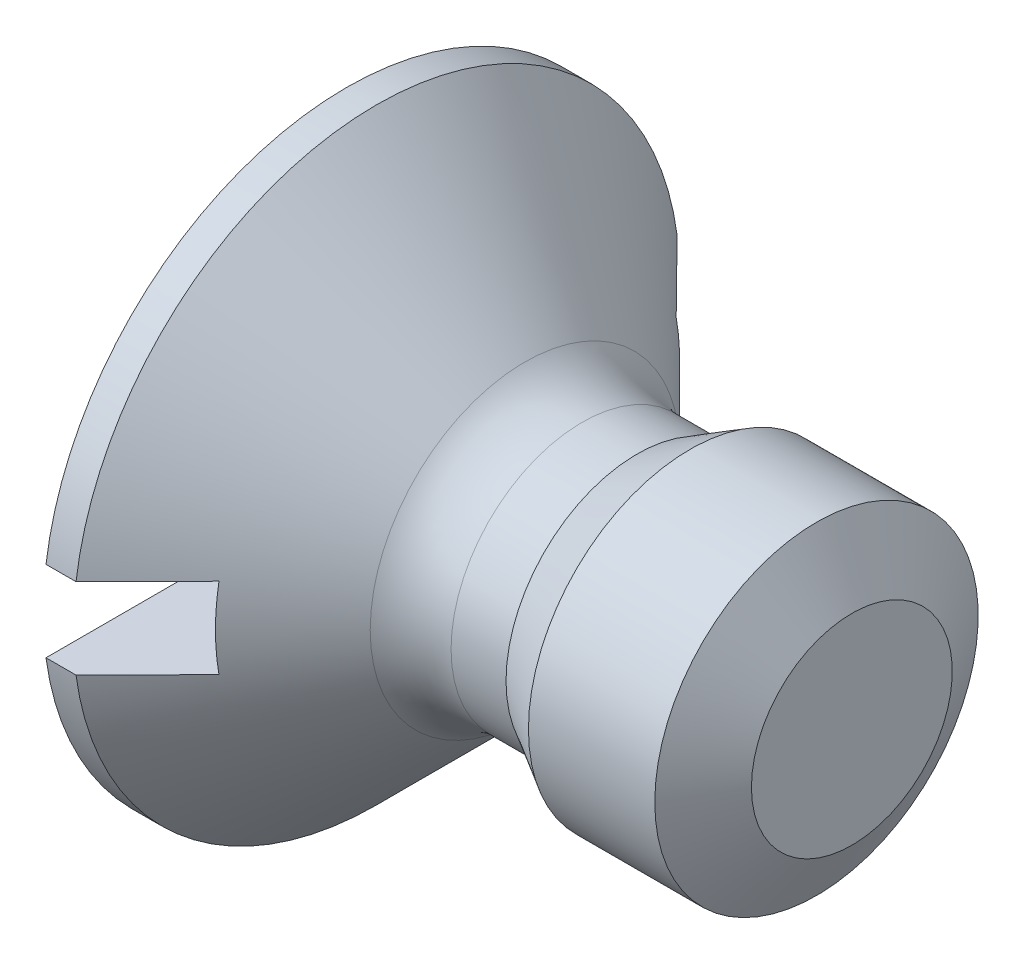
ISO-10303-21;
HEADER;
FILE_DESCRIPTION(('STEP AP214'),'2;1');
FILE_NAME('part.step','',(''),(''),'','','');
FILE_SCHEMA(('AUTOMOTIVE_DESIGN { 1 0 10303 214 1 1 1 1 }'));
ENDSEC;
DATA;
#1=APPLICATION_CONTEXT('core data for automotive mechanical design processes');
#2=APPLICATION_PROTOCOL_DEFINITION('international standard','automotive_design',2000,#1);
#3=PRODUCT_CONTEXT('',#1,'mechanical');
#4=PRODUCT('Part','Part','',(#3));
#5=PRODUCT_RELATED_PRODUCT_CATEGORY('part','',(#4));
#6=PRODUCT_DEFINITION_FORMATION('','',#4);
#7=PRODUCT_DEFINITION_CONTEXT('part definition',#1,'design');
#8=PRODUCT_DEFINITION('design','',#6,#7);
#9=PRODUCT_DEFINITION_SHAPE('','',#8);
#10=(LENGTH_UNIT() NAMED_UNIT(*) SI_UNIT(.MILLI.,.METRE.));
#11=(NAMED_UNIT(*) PLANE_ANGLE_UNIT() SI_UNIT($,.RADIAN.));
#12=(NAMED_UNIT(*) SI_UNIT($,.STERADIAN.) SOLID_ANGLE_UNIT());
#13=UNCERTAINTY_MEASURE_WITH_UNIT(LENGTH_MEASURE(1.E-05),#10,'distance_accuracy_value','');
#14=(GEOMETRIC_REPRESENTATION_CONTEXT(3) GLOBAL_UNCERTAINTY_ASSIGNED_CONTEXT((#13)) GLOBAL_UNIT_ASSIGNED_CONTEXT((#10,
#11,#12)) REPRESENTATION_CONTEXT('',''));
#15=CARTESIAN_POINT('',(0.,0.,0.));
#16=DIRECTION('',(0.,0.,1.));
#17=DIRECTION('',(1.,0.,0.));
#18=AXIS2_PLACEMENT_3D('',#15,#16,#17);
#19=CARTESIAN_POINT('',(0.,0.,0.));
#20=DIRECTION('',(1.,0.,0.));
#21=DIRECTION('',(0.,0.,-1.));
#22=AXIS2_PLACEMENT_3D('',#19,#20,#21);
#23=PLANE('',#22);
#24=CARTESIAN_POINT('',(0.,0.,0.));
#25=DIRECTION('',(-1.,0.,0.));
#26=DIRECTION('',(0.,0.,1.));
#27=AXIS2_PLACEMENT_3D('',#24,#25,#26);
#28=CIRCLE('',#27,1.5);
#29=CARTESIAN_POINT('',(0.,0.2,1.48660687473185));
#30=VERTEX_POINT('',#29);
#31=CARTESIAN_POINT('',(0.,0.2,-1.48660687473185));
#32=VERTEX_POINT('',#31);
#33=EDGE_CURVE('E108',#30,#32,#28,.T.);
#34=ORIENTED_EDGE('',*,*,#33,.T.);
#35=DIRECTION('',(0.,0.,-1.));
#36=VECTOR('',#35,1.);
#37=CARTESIAN_POINT('',(0.,0.2,-1.48660687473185));
#38=LINE('',#37,#36);
#39=EDGE_CURVE('E104',#30,#32,#38,.T.);
#40=ORIENTED_EDGE('',*,*,#39,.F.);
#41=EDGE_LOOP('',(#34,#40));
#42=FACE_BOUND('',#41,.T.);
#43=ADVANCED_FACE('F31',(#42),#23,.F.);
#44=CARTESIAN_POINT('',(0.,0.,0.));
#45=DIRECTION('',(-1.,0.,0.));
#46=DIRECTION('',(0.,0.,1.));
#47=AXIS2_PLACEMENT_3D('',#44,#45,#46);
#48=CYLINDRICAL_SURFACE('',#47,1.5);
#49=CARTESIAN_POINT('',(0.148450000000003,0.,0.));
#50=DIRECTION('',(-1.,0.,0.));
#51=DIRECTION('',(0.,0.,1.));
#52=AXIS2_PLACEMENT_3D('',#49,#50,#51);
#53=CIRCLE('',#52,1.5);
#54=CARTESIAN_POINT('',(0.148450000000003,0.2,1.48660687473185));
#55=VERTEX_POINT('',#54);
#56=CARTESIAN_POINT('',(0.148450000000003,0.2,-1.48660687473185));
#57=VERTEX_POINT('',#56);
#58=EDGE_CURVE('E109',#55,#57,#53,.T.);
#59=ORIENTED_EDGE('',*,*,#58,.T.);
#60=DIRECTION('',(-1.,0.,0.));
#61=VECTOR('',#60,1.);
#62=CARTESIAN_POINT('',(0.5,0.2,-1.48660687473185));
#63=LINE('',#62,#61);
#64=EDGE_CURVE('E60',#57,#32,#63,.T.);
#65=ORIENTED_EDGE('',*,*,#64,.T.);
#66=ORIENTED_EDGE('',*,*,#33,.F.);
#67=DIRECTION('',(-1.,0.,0.));
#68=VECTOR('',#67,1.);
#69=CARTESIAN_POINT('',(0.5,0.2,1.48660687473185));
#70=LINE('',#69,#68);
#71=EDGE_CURVE('E233',#55,#30,#70,.T.);
#72=ORIENTED_EDGE('',*,*,#71,.F.);
#73=EDGE_LOOP('',(#59,#65,#66,#72));
#74=FACE_BOUND('',#73,.T.);
#75=ADVANCED_FACE('F161',(#74),#48,.T.);
#76=CARTESIAN_POINT('',(0.,-0.2,-1.48660687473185));
#77=VERTEX_POINT('',#76);
#78=CARTESIAN_POINT('',(0.,-0.2,1.48660687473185));
#79=VERTEX_POINT('',#78);
#80=EDGE_CURVE('E103',#77,#79,#28,.T.);
#81=ORIENTED_EDGE('',*,*,#80,.T.);
#82=DIRECTION('',(0.,0.,1.));
#83=VECTOR('',#82,1.);
#84=CARTESIAN_POINT('',(0.,-0.2,-1.48660687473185));
#85=LINE('',#84,#83);
#86=EDGE_CURVE('E91',#77,#79,#85,.T.);
#87=ORIENTED_EDGE('',*,*,#86,.F.);
#88=EDGE_LOOP('',(#81,#87));
#89=FACE_BOUND('',#88,.T.);
#90=ADVANCED_FACE('F33',(#89),#23,.F.);
#91=CARTESIAN_POINT('',(0.148450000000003,-0.2,-1.48660687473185));
#92=VERTEX_POINT('',#91);
#93=CARTESIAN_POINT('',(0.148450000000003,-0.2,1.48660687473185));
#94=VERTEX_POINT('',#93);
#95=EDGE_CURVE('E114',#92,#94,#53,.T.);
#96=ORIENTED_EDGE('',*,*,#95,.T.);
#97=DIRECTION('',(-1.,0.,0.));
#98=VECTOR('',#97,1.);
#99=CARTESIAN_POINT('',(0.5,-0.2,1.48660687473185));
#100=LINE('',#99,#98);
#101=EDGE_CURVE('E98',#94,#79,#100,.T.);
#102=ORIENTED_EDGE('',*,*,#101,.T.);
#103=ORIENTED_EDGE('',*,*,#80,.F.);
#104=DIRECTION('',(-1.,0.,0.));
#105=VECTOR('',#104,1.);
#106=CARTESIAN_POINT('',(0.5,-0.2,-1.48660687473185));
#107=LINE('',#106,#105);
#108=EDGE_CURVE('E88',#92,#77,#107,.T.);
#109=ORIENTED_EDGE('',*,*,#108,.F.);
#110=EDGE_LOOP('',(#96,#102,#103,#109));
#111=FACE_BOUND('',#110,.T.);
#112=ADVANCED_FACE('F107',(#111),#48,.T.);
#113=CARTESIAN_POINT('',(0.882842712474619,0.,0.));
#114=DIRECTION('',(-1.,0.,0.));
#115=DIRECTION('',(0.,0.,1.));
#116=AXIS2_PLACEMENT_3D('',#113,#114,#115);
#117=CONICAL_SURFACE('',#116,0.765607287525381,0.78539816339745);
#118=CARTESIAN_POINT('',(0.5,0.,0.));
#119=DIRECTION('',(-1.,0.,0.));
#120=DIRECTION('',(0.,0.,1.));
#121=AXIS2_PLACEMENT_3D('',#118,#119,#120);
#122=CIRCLE('',#121,1.14845);
#123=CARTESIAN_POINT('',(0.5,0.2,-1.1309011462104));
#124=VERTEX_POINT('',#123);
#125=CARTESIAN_POINT('',(0.5,-0.2,-1.1309011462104));
#126=VERTEX_POINT('',#125);
#127=EDGE_CURVE('E119',#124,#126,#122,.T.);
#128=ORIENTED_EDGE('',*,*,#127,.F.);
#129=CARTESIAN_POINT('',(-1.64079797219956,0.2,3.28316192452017));
#130=CARTESIAN_POINT('',(-1.52906235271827,0.2,3.17121753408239));
#131=CARTESIAN_POINT('',(-1.41733577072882,0.2,3.0592641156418));
#132=CARTESIAN_POINT('',(-1.1939105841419,0.2,2.83532606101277));
#133=CARTESIAN_POINT('',(-1.08221197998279,0.2,2.72334142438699));
#134=CARTESIAN_POINT('',(-0.858818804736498,0.2,2.49929382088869));
#135=CARTESIAN_POINT('',(-0.747124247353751,0.2,2.38723084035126));
#136=CARTESIAN_POINT('',(-0.523798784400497,0.2,2.16304467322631));
#137=CARTESIAN_POINT('',(-0.412167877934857,0.2,2.05092148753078));
#138=CARTESIAN_POINT('',(-0.1856595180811,0.2,1.82321087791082));
#139=CARTESIAN_POINT('',(-0.0707851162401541,0.2,1.70762041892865));
#140=CARTESIAN_POINT('',(0.15878464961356,0.2,1.47625178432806));
#141=CARTESIAN_POINT('',(0.273480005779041,0.2,1.36047360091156));
#142=CARTESIAN_POINT('',(0.445217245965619,0.2,1.18652874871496));
#143=CARTESIAN_POINT('',(0.502405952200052,0.2,1.12850706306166));
#144=CARTESIAN_POINT('',(0.616628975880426,0.2,1.01230966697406));
#145=CARTESIAN_POINT('',(0.673663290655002,0.2,0.954133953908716));
#146=CARTESIAN_POINT('',(0.787464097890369,0.2,0.837530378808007));
#147=CARTESIAN_POINT('',(0.84423061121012,0.2,0.779102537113));
#148=CARTESIAN_POINT('',(0.957287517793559,0.2,0.661788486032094));
#149=CARTESIAN_POINT('',(1.01357792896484,0.2,0.602902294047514));
#150=CARTESIAN_POINT('',(1.08433312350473,0.2,0.527500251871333));
#151=CARTESIAN_POINT('',(1.09930695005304,0.2,0.511463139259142));
#152=CARTESIAN_POINT('',(1.12914382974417,0.2,0.479285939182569));
#153=CARTESIAN_POINT('',(1.14400688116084,0.2,0.463145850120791));
#154=CARTESIAN_POINT('',(1.18830724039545,0.2,0.414620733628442));
#155=CARTESIAN_POINT('',(1.21753737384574,0.2,0.382044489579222));
#156=CARTESIAN_POINT('',(1.26461313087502,0.2,0.327781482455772));
#157=CARTESIAN_POINT('',(1.28278251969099,0.2,0.306378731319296));
#158=CARTESIAN_POINT('',(1.31841836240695,0.2,0.26282885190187));
#159=CARTESIAN_POINT('',(1.33588112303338,0.2,0.240678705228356));
#160=CARTESIAN_POINT('',(1.36955751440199,0.2,0.195012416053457));
#161=CARTESIAN_POINT('',(1.3857554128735,0.2,0.171483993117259));
#162=CARTESIAN_POINT('',(1.40749300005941,0.2,0.134735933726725));
#163=CARTESIAN_POINT('',(1.41429686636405,0.2,0.12228076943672));
#164=CARTESIAN_POINT('',(1.42656593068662,0.2,0.0967396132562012));
#165=CARTESIAN_POINT('',(1.43203406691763,0.2,0.0836550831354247));
#166=CARTESIAN_POINT('',(1.4408859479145,0.2,0.0569118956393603));
#167=CARTESIAN_POINT('',(1.44429105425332,0.2,0.0432607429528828));
#168=CARTESIAN_POINT('',(1.44830199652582,0.2,0.0155962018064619));
#169=CARTESIAN_POINT('',(1.44892316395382,0.2,0.00158522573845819));
#170=CARTESIAN_POINT('',(1.44721841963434,0.2,-0.026228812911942));
#171=CARTESIAN_POINT('',(1.44489488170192,0.2,-0.0400320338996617));
#172=CARTESIAN_POINT('',(1.43791126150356,0.2,-0.067083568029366));
#173=CARTESIAN_POINT('',(1.43323625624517,0.2,-0.0803277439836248));
#174=CARTESIAN_POINT('',(1.42062778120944,0.2,-0.110185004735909));
#175=CARTESIAN_POINT('',(1.41213213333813,0.2,-0.126550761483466));
#176=CARTESIAN_POINT('',(1.39363560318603,0.2,-0.158424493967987));
#177=CARTESIAN_POINT('',(1.38363068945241,0.2,-0.173930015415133));
#178=CARTESIAN_POINT('',(1.36266689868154,0.2,-0.204438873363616));
#179=CARTESIAN_POINT('',(1.35170166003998,0.2,-0.219437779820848));
#180=CARTESIAN_POINT('',(1.32922788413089,0.2,-0.248984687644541));
#181=CARTESIAN_POINT('',(1.31772011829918,0.2,-0.263533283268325));
#182=CARTESIAN_POINT('',(1.27872953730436,0.2,-0.311589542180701));
#183=CARTESIAN_POINT('',(1.25045219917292,0.2,-0.344448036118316));
#184=CARTESIAN_POINT('',(1.1930407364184,0.2,-0.409411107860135));
#185=CARTESIAN_POINT('',(1.16390628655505,0.2,-0.441515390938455));
#186=CARTESIAN_POINT('',(1.1051245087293,0.2,-0.505329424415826));
#187=CARTESIAN_POINT('',(1.07547655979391,0.2,-0.537038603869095));
#188=CARTESIAN_POINT('',(1.01590439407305,0.2,-0.600184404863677));
#189=CARTESIAN_POINT('',(0.985980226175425,0.2,-0.631621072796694));
#190=CARTESIAN_POINT('',(0.89633646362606,0.2,-0.72526216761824));
#191=CARTESIAN_POINT('',(0.836354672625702,0.2,-0.787215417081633));
#192=CARTESIAN_POINT('',(0.716096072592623,0.2,-0.910754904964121));
#193=CARTESIAN_POINT('',(0.655819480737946,0.2,-0.972341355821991));
#194=CARTESIAN_POINT('',(0.503365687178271,0.2,-1.12762695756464));
#195=CARTESIAN_POINT('',(0.411062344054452,0.2,-1.22120227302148));
#196=CARTESIAN_POINT('',(0.226241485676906,0.2,-1.40814209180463));
#197=CARTESIAN_POINT('',(0.133723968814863,0.2,-1.50150659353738));
#198=CARTESIAN_POINT('',(-0.144062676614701,0.2,-1.78147675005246));
#199=CARTESIAN_POINT('',(-0.329511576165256,0.2,-1.96790402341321));
#200=CARTESIAN_POINT('',(-0.702570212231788,0.2,-2.34255801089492));
#201=CARTESIAN_POINT('',(-0.890181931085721,0.2,-2.53078274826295));
#202=CARTESIAN_POINT('',(-1.26545669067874,0.2,-2.90706401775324));
#203=CARTESIAN_POINT('',(-1.45311969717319,0.2,-3.09512058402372));
#204=CARTESIAN_POINT('',(-1.64079797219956,0.2,-3.28316192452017));
#205=B_SPLINE_CURVE_WITH_KNOTS('',3,(#129,#130,#131,#132,#133,#134,#135,#136,#137,#138,#139,
#140,#141,#142,#143,#144,#145,#146,#147,#148,#149,#150,#151,#152,#153,#154,#155,#156,#157,#158,
#159,#160,#161,#162,#163,#164,#165,#166,#167,#168,#169,#170,#171,#172,#173,#174,#175,#176,#177,
#178,#179,#180,#181,#182,#183,#184,#185,#186,#187,#188,#189,#190,#191,#192,#193,#194,#195,#196,
#197,#198,#199,#200,#201,#202,#203,#204),.UNSPECIFIED.,.F.,.F.,(4,2,2,2,2,2,2,2,2,2,2,2,2,2,2,2,
2,2,2,2,2,2,2,2,2,2,2,2,2,2,2,2,2,2,2,2,2,4),(0.,0.474497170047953,0.949001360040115,
1.42366341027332,1.89831861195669,2.38721073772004,2.87612372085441,3.12052815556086,
3.36493679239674,3.60932606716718,3.85370610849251,3.91952837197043,3.98535165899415,
4.11664175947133,4.20085258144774,4.28545804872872,4.37098789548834,4.41351615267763,
4.45595000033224,4.49793660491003,4.53969169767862,4.58141315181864,4.62340278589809,
4.67857158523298,4.73389044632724,4.78960840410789,4.8452493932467,4.97525677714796,
5.10531414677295,5.23554162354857,5.3657464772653,5.62443991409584,5.88296514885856,
6.27728151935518,6.67160086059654,7.46047152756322,8.25774212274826,9.0547641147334),.UNSPECIFIED.);
#206=EDGE_CURVE('E11',#124,#57,#205,.T.);
#207=ORIENTED_EDGE('',*,*,#206,.T.);
#208=ORIENTED_EDGE('',*,*,#58,.F.);
#209=CARTESIAN_POINT('',(0.5,0.2,1.1309011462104));
#210=VERTEX_POINT('',#209);
#211=EDGE_CURVE('E35',#55,#210,#205,.T.);
#212=ORIENTED_EDGE('',*,*,#211,.T.);
#213=CARTESIAN_POINT('',(0.5,-0.2,1.1309011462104));
#214=VERTEX_POINT('',#213);
#215=EDGE_CURVE('E112',#214,#210,#122,.T.);
#216=ORIENTED_EDGE('',*,*,#215,.F.);
#217=CARTESIAN_POINT('',(-1.64079797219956,-0.2,-3.28316192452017));
#218=CARTESIAN_POINT('',(-1.52906235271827,-0.2,-3.17121753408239));
#219=CARTESIAN_POINT('',(-1.41733577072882,-0.2,-3.0592641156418));
#220=CARTESIAN_POINT('',(-1.1939105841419,-0.2,-2.83532606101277));
#221=CARTESIAN_POINT('',(-1.08221197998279,-0.2,-2.72334142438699));
#222=CARTESIAN_POINT('',(-0.858818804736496,-0.2,-2.49929382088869));
#223=CARTESIAN_POINT('',(-0.747124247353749,-0.2,-2.38723084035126));
#224=CARTESIAN_POINT('',(-0.523798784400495,-0.2,-2.1630446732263));
#225=CARTESIAN_POINT('',(-0.412167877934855,-0.2,-2.05092148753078));
#226=CARTESIAN_POINT('',(-0.185659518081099,-0.2,-1.82321087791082));
#227=CARTESIAN_POINT('',(-0.0707851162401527,-0.2,-1.70762041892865));
#228=CARTESIAN_POINT('',(0.158784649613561,-0.2,-1.47625178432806));
#229=CARTESIAN_POINT('',(0.273480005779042,-0.2,-1.36047360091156));
#230=CARTESIAN_POINT('',(0.445217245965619,-0.2,-1.18652874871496));
#231=CARTESIAN_POINT('',(0.502405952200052,-0.2,-1.12850706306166));
#232=CARTESIAN_POINT('',(0.616628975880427,-0.2,-1.01230966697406));
#233=CARTESIAN_POINT('',(0.673663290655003,-0.2,-0.954133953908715));
#234=CARTESIAN_POINT('',(0.787464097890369,-0.2,-0.837530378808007));
#235=CARTESIAN_POINT('',(0.844230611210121,-0.2,-0.779102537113));
#236=CARTESIAN_POINT('',(0.957287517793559,-0.2,-0.661788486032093));
#237=CARTESIAN_POINT('',(1.01357792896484,-0.2,-0.602902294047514));
#238=CARTESIAN_POINT('',(1.08433312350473,-0.2,-0.527500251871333));
#239=CARTESIAN_POINT('',(1.09930695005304,-0.2,-0.511463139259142));
#240=CARTESIAN_POINT('',(1.12914382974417,-0.2,-0.479285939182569));
#241=CARTESIAN_POINT('',(1.14400688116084,-0.2,-0.463145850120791));
#242=CARTESIAN_POINT('',(1.18830724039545,-0.2,-0.414620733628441));
#243=CARTESIAN_POINT('',(1.21753737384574,-0.2,-0.382044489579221));
#244=CARTESIAN_POINT('',(1.26461313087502,-0.2,-0.327781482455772));
#245=CARTESIAN_POINT('',(1.28278251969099,-0.2,-0.306378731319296));
#246=CARTESIAN_POINT('',(1.31841836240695,-0.2,-0.26282885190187));
#247=CARTESIAN_POINT('',(1.33588112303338,-0.2,-0.240678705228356));
#248=CARTESIAN_POINT('',(1.36955751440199,-0.2,-0.195012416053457));
#249=CARTESIAN_POINT('',(1.3857554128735,-0.2,-0.171483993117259));
#250=CARTESIAN_POINT('',(1.40749300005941,-0.2,-0.134735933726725));
#251=CARTESIAN_POINT('',(1.41429686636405,-0.2,-0.12228076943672));
#252=CARTESIAN_POINT('',(1.42656593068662,-0.2,-0.0967396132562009));
#253=CARTESIAN_POINT('',(1.43203406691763,-0.2,-0.0836550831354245));
#254=CARTESIAN_POINT('',(1.4408859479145,-0.2,-0.0569118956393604));
#255=CARTESIAN_POINT('',(1.44429105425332,-0.2,-0.0432607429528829));
#256=CARTESIAN_POINT('',(1.44830199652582,-0.2,-0.015596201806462));
#257=CARTESIAN_POINT('',(1.44892316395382,-0.2,-0.00158522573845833));
#258=CARTESIAN_POINT('',(1.44721841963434,-0.2,0.0262288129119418));
#259=CARTESIAN_POINT('',(1.44489488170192,-0.2,0.0400320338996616));
#260=CARTESIAN_POINT('',(1.43791126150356,-0.2,0.0670835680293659));
#261=CARTESIAN_POINT('',(1.43323625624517,-0.2,0.0803277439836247));
#262=CARTESIAN_POINT('',(1.42062778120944,-0.2,0.110185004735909));
#263=CARTESIAN_POINT('',(1.41213213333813,-0.2,0.126550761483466));
#264=CARTESIAN_POINT('',(1.39363560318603,-0.2,0.158424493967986));
#265=CARTESIAN_POINT('',(1.38363068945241,-0.2,0.173930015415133));
#266=CARTESIAN_POINT('',(1.36266689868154,-0.2,0.204438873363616));
#267=CARTESIAN_POINT('',(1.35170166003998,-0.2,0.219437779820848));
#268=CARTESIAN_POINT('',(1.32922788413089,-0.2,0.248984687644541));
#269=CARTESIAN_POINT('',(1.31772011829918,-0.2,0.263533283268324));
#270=CARTESIAN_POINT('',(1.27872953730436,-0.2,0.3115895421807));
#271=CARTESIAN_POINT('',(1.25045219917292,-0.2,0.344448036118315));
#272=CARTESIAN_POINT('',(1.19304073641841,-0.2,0.409411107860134));
#273=CARTESIAN_POINT('',(1.16390628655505,-0.2,0.441515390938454));
#274=CARTESIAN_POINT('',(1.1051245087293,-0.2,0.505329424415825));
#275=CARTESIAN_POINT('',(1.07547655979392,-0.2,0.537038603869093));
#276=CARTESIAN_POINT('',(1.01590439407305,-0.2,0.600184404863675));
#277=CARTESIAN_POINT('',(0.985980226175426,-0.2,0.631621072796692));
#278=CARTESIAN_POINT('',(0.896336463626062,-0.2,0.725262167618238));
#279=CARTESIAN_POINT('',(0.836354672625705,-0.2,0.787215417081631));
#280=CARTESIAN_POINT('',(0.716096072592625,-0.2,0.910754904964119));
#281=CARTESIAN_POINT('',(0.655819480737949,-0.2,0.972341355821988));
#282=CARTESIAN_POINT('',(0.503365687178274,-0.2,1.12762695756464));
#283=CARTESIAN_POINT('',(0.411062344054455,-0.2,1.22120227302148));
#284=CARTESIAN_POINT('',(0.226241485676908,-0.2,1.40814209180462));
#285=CARTESIAN_POINT('',(0.133723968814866,-0.2,1.50150659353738));
#286=CARTESIAN_POINT('',(-0.144062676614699,-0.2,1.78147675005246));
#287=CARTESIAN_POINT('',(-0.329511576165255,-0.2,1.9679040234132));
#288=CARTESIAN_POINT('',(-0.702570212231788,-0.2,2.34255801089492));
#289=CARTESIAN_POINT('',(-0.890181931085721,-0.2,2.53078274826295));
#290=CARTESIAN_POINT('',(-1.26545669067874,-0.2,2.90706401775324));
#291=CARTESIAN_POINT('',(-1.45311969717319,-0.2,3.09512058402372));
#292=CARTESIAN_POINT('',(-1.64079797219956,-0.2,3.28316192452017));
#293=B_SPLINE_CURVE_WITH_KNOTS('',3,(#217,#218,#219,#220,#221,#222,#223,#224,#225,#226,#227,
#228,#229,#230,#231,#232,#233,#234,#235,#236,#237,#238,#239,#240,#241,#242,#243,#244,#245,#246,
#247,#248,#249,#250,#251,#252,#253,#254,#255,#256,#257,#258,#259,#260,#261,#262,#263,#264,#265,
#266,#267,#268,#269,#270,#271,#272,#273,#274,#275,#276,#277,#278,#279,#280,#281,#282,#283,#284,
#285,#286,#287,#288,#289,#290,#291,#292),.UNSPECIFIED.,.F.,.F.,(4,2,2,2,2,2,2,2,2,2,2,2,2,2,2,2,
2,2,2,2,2,2,2,2,2,2,2,2,2,2,2,2,2,2,2,2,2,4),(0.,0.474497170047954,0.949001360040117,
1.42366341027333,1.89831861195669,2.38721073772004,2.87612372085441,3.12052815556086,
3.36493679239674,3.60932606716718,3.85370610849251,3.91952837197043,3.98535165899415,
4.11664175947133,4.20085258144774,4.28545804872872,4.37098789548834,4.41351615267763,
4.45595000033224,4.49793660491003,4.53969169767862,4.58141315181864,4.62340278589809,
4.67857158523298,4.73389044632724,4.78960840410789,4.8452493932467,4.97525677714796,
5.10531414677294,5.23554162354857,5.36574647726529,5.62443991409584,5.88296514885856,
6.27728151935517,6.67160086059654,7.46047152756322,8.25774212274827,9.0547641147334),.UNSPECIFIED.);
#294=EDGE_CURVE('E118',#214,#94,#293,.T.);
#295=ORIENTED_EDGE('',*,*,#294,.T.);
#296=ORIENTED_EDGE('',*,*,#95,.F.);
#297=EDGE_CURVE('E45',#92,#126,#293,.T.);
#298=ORIENTED_EDGE('',*,*,#297,.T.);
#299=EDGE_LOOP('',(#128,#207,#208,#212,#216,#295,#296,#298));
#300=FACE_BOUND('',#299,.T.);
#301=CARTESIAN_POINT('',(0.882842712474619,0.,0.));
#302=DIRECTION('',(-1.,0.,0.));
#303=DIRECTION('',(0.,0.,1.));
#304=AXIS2_PLACEMENT_3D('',#301,#302,#303);
#305=CIRCLE('',#304,0.765607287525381);
#306=CARTESIAN_POINT('',(0.882842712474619,0.,0.765607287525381));
#307=VERTEX_POINT('',#306);
#308=EDGE_CURVE('E243',#307,#307,#305,.T.);
#309=ORIENTED_EDGE('',*,*,#308,.T.);
#310=EDGE_LOOP('',(#309));
#311=FACE_BOUND('',#310,.T.);
#312=ADVANCED_FACE('F125',(#300,#311),#117,.T.);
#313=CARTESIAN_POINT('',(1.16568542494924,0.,0.));
#314=DIRECTION('',(-1.,0.,0.));
#315=DIRECTION('',(0.,0.,1.));
#316=AXIS2_PLACEMENT_3D('',#313,#314,#315);
#317=TOROIDAL_SURFACE('',#316,1.04845,0.4);
#318=ORIENTED_EDGE('',*,*,#308,.F.);
#319=EDGE_LOOP('',(#318));
#320=FACE_BOUND('',#319,.T.);
#321=CARTESIAN_POINT('',(1.16568542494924,0.,0.));
#322=DIRECTION('',(-1.,0.,0.));
#323=DIRECTION('',(0.,0.,1.));
#324=AXIS2_PLACEMENT_3D('',#321,#322,#323);
#325=CIRCLE('',#324,0.64845);
#326=CARTESIAN_POINT('',(1.16568542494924,0.,0.64845));
#327=VERTEX_POINT('',#326);
#328=EDGE_CURVE('E241',#327,#327,#325,.T.);
#329=ORIENTED_EDGE('',*,*,#328,.T.);
#330=EDGE_LOOP('',(#329));
#331=FACE_BOUND('',#330,.T.);
#332=ADVANCED_FACE('F150',(#320,#331),#317,.F.);
#333=CARTESIAN_POINT('',(0.,0.,0.));
#334=DIRECTION('',(-1.,0.,0.));
#335=DIRECTION('',(0.,0.,1.));
#336=AXIS2_PLACEMENT_3D('',#333,#334,#335);
#337=CYLINDRICAL_SURFACE('',#336,0.64845);
#338=ORIENTED_EDGE('',*,*,#328,.F.);
#339=EDGE_LOOP('',(#338));
#340=FACE_BOUND('',#339,.T.);
#341=CARTESIAN_POINT('',(1.43750770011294,0.,0.));
#342=DIRECTION('',(-1.,0.,0.));
#343=DIRECTION('',(0.,0.,1.));
#344=AXIS2_PLACEMENT_3D('',#341,#342,#343);
#345=CIRCLE('',#344,0.64845);
#346=CARTESIAN_POINT('',(1.43750770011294,0.,0.64845));
#347=VERTEX_POINT('',#346);
#348=EDGE_CURVE('E238',#347,#347,#345,.T.);
#349=ORIENTED_EDGE('',*,*,#348,.T.);
#350=EDGE_LOOP('',(#349));
#351=FACE_BOUND('',#350,.T.);
#352=ADVANCED_FACE('F147',(#340,#351),#337,.T.);
#353=CARTESIAN_POINT('',(1.7,0.,0.));
#354=DIRECTION('',(1.,0.,0.));
#355=DIRECTION('',(0.,0.,-1.));
#356=AXIS2_PLACEMENT_3D('',#353,#354,#355);
#357=CONICAL_SURFACE('',#356,0.8,0.5235987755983);
#358=ORIENTED_EDGE('',*,*,#348,.F.);
#359=EDGE_LOOP('',(#358));
#360=FACE_BOUND('',#359,.T.);
#361=CARTESIAN_POINT('',(1.7,0.,0.));
#362=DIRECTION('',(-1.,0.,0.));
#363=DIRECTION('',(0.,0.,1.));
#364=AXIS2_PLACEMENT_3D('',#361,#362,#363);
#365=CIRCLE('',#364,0.8);
#366=CARTESIAN_POINT('',(1.7,0.,0.8));
#367=VERTEX_POINT('',#366);
#368=EDGE_CURVE('E232',#367,#367,#365,.T.);
#369=ORIENTED_EDGE('',*,*,#368,.T.);
#370=EDGE_LOOP('',(#369));
#371=FACE_BOUND('',#370,.T.);
#372=ADVANCED_FACE('F143',(#360,#371),#357,.T.);
#373=CARTESIAN_POINT('',(0.,0.,0.));
#374=DIRECTION('',(-1.,0.,0.));
#375=DIRECTION('',(0.,0.,1.));
#376=AXIS2_PLACEMENT_3D('',#373,#374,#375);
#377=CYLINDRICAL_SURFACE('',#376,0.8);
#378=CARTESIAN_POINT('',(2.325,0.,0.));
#379=DIRECTION('',(-1.,0.,0.));
#380=DIRECTION('',(0.,0.,1.));
#381=AXIS2_PLACEMENT_3D('',#378,#379,#380);
#382=CIRCLE('',#381,0.8);
#383=CARTESIAN_POINT('',(2.325,0.,0.8));
#384=VERTEX_POINT('',#383);
#385=EDGE_CURVE('E223',#384,#384,#382,.T.);
#386=ORIENTED_EDGE('',*,*,#385,.T.);
#387=EDGE_LOOP('',(#386));
#388=FACE_BOUND('',#387,.T.);
#389=ORIENTED_EDGE('',*,*,#368,.F.);
#390=EDGE_LOOP('',(#389));
#391=FACE_BOUND('',#390,.T.);
#392=ADVANCED_FACE('F140',(#388,#391),#377,.T.);
#393=CARTESIAN_POINT('',(0.5,0.2,-1.48660687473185));
#394=DIRECTION('',(0.,1.,0.));
#395=DIRECTION('',(0.,0.,1.));
#396=AXIS2_PLACEMENT_3D('',#393,#394,#395);
#397=PLANE('',#396);
#398=ORIENTED_EDGE('',*,*,#71,.T.);
#399=ORIENTED_EDGE('',*,*,#39,.T.);
#400=ORIENTED_EDGE('',*,*,#64,.F.);
#401=ORIENTED_EDGE('',*,*,#206,.F.);
#402=DIRECTION('',(0.,0.,-1.));
#403=VECTOR('',#402,1.);
#404=CARTESIAN_POINT('',(0.5,0.2,-1.48660687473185));
#405=LINE('',#404,#403);
#406=EDGE_CURVE('E99',#210,#124,#405,.T.);
#407=ORIENTED_EDGE('',*,*,#406,.F.);
#408=ORIENTED_EDGE('',*,*,#211,.F.);
#409=EDGE_LOOP('',(#398,#399,#400,#401,#407,#408));
#410=FACE_BOUND('',#409,.T.);
#411=ADVANCED_FACE('F132',(#410),#397,.F.);
#412=CARTESIAN_POINT('',(0.5,-0.2,-1.48660687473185));
#413=DIRECTION('',(0.,-1.,0.));
#414=DIRECTION('',(0.,0.,-1.));
#415=AXIS2_PLACEMENT_3D('',#412,#413,#414);
#416=PLANE('',#415);
#417=ORIENTED_EDGE('',*,*,#108,.T.);
#418=ORIENTED_EDGE('',*,*,#86,.T.);
#419=ORIENTED_EDGE('',*,*,#101,.F.);
#420=ORIENTED_EDGE('',*,*,#294,.F.);
#421=DIRECTION('',(0.,0.,1.));
#422=VECTOR('',#421,1.);
#423=CARTESIAN_POINT('',(0.5,-0.2,-1.48660687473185));
#424=LINE('',#423,#422);
#425=EDGE_CURVE('E52',#126,#214,#424,.T.);
#426=ORIENTED_EDGE('',*,*,#425,.F.);
#427=ORIENTED_EDGE('',*,*,#297,.F.);
#428=EDGE_LOOP('',(#417,#418,#419,#420,#426,#427));
#429=FACE_BOUND('',#428,.T.);
#430=ADVANCED_FACE('F90',(#429),#416,.F.);
#431=CARTESIAN_POINT('',(0.5,0.,0.));
#432=DIRECTION('',(-1.,0.,0.));
#433=DIRECTION('',(0.,0.,1.));
#434=AXIS2_PLACEMENT_3D('',#431,#432,#433);
#435=PLANE('',#434);
#436=ORIENTED_EDGE('',*,*,#127,.T.);
#437=ORIENTED_EDGE('',*,*,#425,.T.);
#438=ORIENTED_EDGE('',*,*,#215,.T.);
#439=ORIENTED_EDGE('',*,*,#406,.T.);
#440=EDGE_LOOP('',(#436,#437,#438,#439));
#441=FACE_BOUND('',#440,.T.);
#442=ADVANCED_FACE('F131',(#441),#435,.T.);
#443=CARTESIAN_POINT('',(2.325,0.,0.));
#444=DIRECTION('',(-1.,0.,0.));
#445=DIRECTION('',(0.,0.,1.));
#446=AXIS2_PLACEMENT_3D('',#443,#444,#445);
#447=CONICAL_SURFACE('',#446,0.8,1.04719755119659);
#448=CARTESIAN_POINT('',(2.5,0.,0.));
#449=DIRECTION('',(-1.,0.,0.));
#450=DIRECTION('',(0.,0.,1.));
#451=AXIS2_PLACEMENT_3D('',#448,#449,#450);
#452=CIRCLE('',#451,0.496891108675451);
#453=CARTESIAN_POINT('',(2.5,0.,0.496891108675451));
#454=VERTEX_POINT('',#453);
#455=EDGE_CURVE('E105',#454,#454,#452,.T.);
#456=ORIENTED_EDGE('',*,*,#455,.T.);
#457=EDGE_LOOP('',(#456));
#458=FACE_BOUND('',#457,.T.);
#459=ORIENTED_EDGE('',*,*,#385,.F.);
#460=EDGE_LOOP('',(#459));
#461=FACE_BOUND('',#460,.T.);
#462=ADVANCED_FACE('F138',(#458,#461),#447,.T.);
#463=CARTESIAN_POINT('',(2.5,0.8,0.));
#464=DIRECTION('',(-1.,0.,0.));
#465=DIRECTION('',(0.,0.,1.));
#466=AXIS2_PLACEMENT_3D('',#463,#464,#465);
#467=PLANE('',#466);
#468=ORIENTED_EDGE('',*,*,#455,.F.);
#469=EDGE_LOOP('',(#468));
#470=FACE_BOUND('',#469,.T.);
#471=ADVANCED_FACE('F135',(#470),#467,.F.);
#472=CLOSED_SHELL('',(#43,#75,#90,#112,#312,#332,#352,#372,#392,#411,#430,#442,#462,#471));
#473=MANIFOLD_SOLID_BREP('B2',#472);
#474=ADVANCED_BREP_SHAPE_REPRESENTATION('',(#18,#473),#14);
#475=SHAPE_DEFINITION_REPRESENTATION(#9,#474);
ENDSEC;
END-ISO-10303-21;
